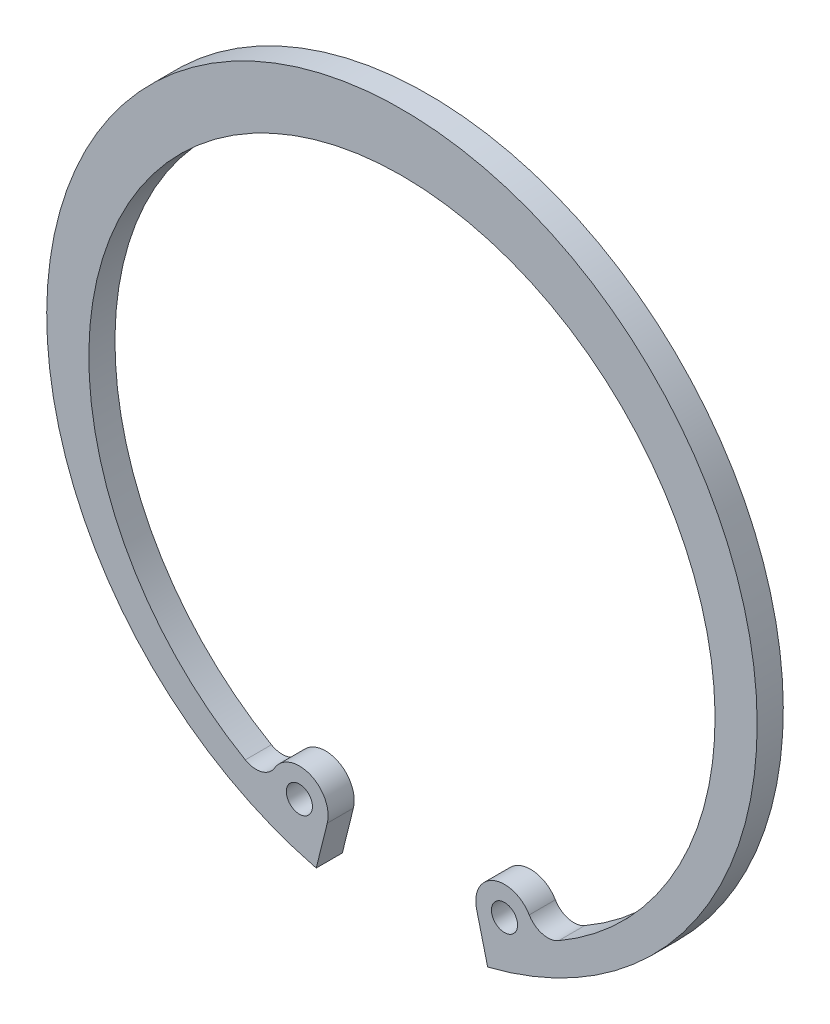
ISO-10303-21;
HEADER;
FILE_DESCRIPTION(('STEP AP214'),'2;1');
FILE_NAME('part.step','',(''),(''),'','','');
FILE_SCHEMA(('AUTOMOTIVE_DESIGN { 1 0 10303 214 1 1 1 1 }'));
ENDSEC;
DATA;
#1=APPLICATION_CONTEXT('core data for automotive mechanical design processes');
#2=APPLICATION_PROTOCOL_DEFINITION('international standard','automotive_design',2000,#1);
#3=PRODUCT_CONTEXT('',#1,'mechanical');
#4=PRODUCT('Part','Part','',(#3));
#5=PRODUCT_RELATED_PRODUCT_CATEGORY('part','',(#4));
#6=PRODUCT_DEFINITION_FORMATION('','',#4);
#7=PRODUCT_DEFINITION_CONTEXT('part definition',#1,'design');
#8=PRODUCT_DEFINITION('design','',#6,#7);
#9=PRODUCT_DEFINITION_SHAPE('','',#8);
#10=(LENGTH_UNIT() NAMED_UNIT(*) SI_UNIT(.MILLI.,.METRE.));
#11=(NAMED_UNIT(*) PLANE_ANGLE_UNIT() SI_UNIT($,.RADIAN.));
#12=(NAMED_UNIT(*) SI_UNIT($,.STERADIAN.) SOLID_ANGLE_UNIT());
#13=UNCERTAINTY_MEASURE_WITH_UNIT(LENGTH_MEASURE(1.E-05),#10,'distance_accuracy_value','');
#14=(GEOMETRIC_REPRESENTATION_CONTEXT(3) GLOBAL_UNCERTAINTY_ASSIGNED_CONTEXT((#13)) GLOBAL_UNIT_ASSIGNED_CONTEXT((#10,
#11,#12)) REPRESENTATION_CONTEXT('',''));
#15=CARTESIAN_POINT('',(0.,0.,0.));
#16=DIRECTION('',(0.,0.,1.));
#17=DIRECTION('',(1.,0.,0.));
#18=AXIS2_PLACEMENT_3D('',#15,#16,#17);
#19=CARTESIAN_POINT('',(0.,0.,-2.5));
#20=DIRECTION('',(0.,0.,1.));
#21=DIRECTION('',(1.,0.,0.));
#22=AXIS2_PLACEMENT_3D('',#19,#20,#21);
#23=CYLINDRICAL_SURFACE('',#22,34.);
#24=CARTESIAN_POINT('',(0.,0.,0.));
#25=DIRECTION('',(0.,0.,1.));
#26=DIRECTION('',(1.,0.,0.));
#27=AXIS2_PLACEMENT_3D('',#24,#25,#26);
#28=CIRCLE('',#27,34.);
#29=CARTESIAN_POINT('',(8.20417418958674,-32.9953258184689,0.));
#30=VERTEX_POINT('',#29);
#31=CARTESIAN_POINT('',(-8.20417418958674,-32.9953258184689,0.));
#32=VERTEX_POINT('',#31);
#33=EDGE_CURVE('E127',#30,#32,#28,.T.);
#34=ORIENTED_EDGE('',*,*,#33,.F.);
#35=DIRECTION('',(0.,0.,1.));
#36=VECTOR('',#35,1.);
#37=CARTESIAN_POINT('',(8.20417418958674,-32.9953258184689,-2.5));
#38=LINE('',#37,#36);
#39=CARTESIAN_POINT('',(8.20417418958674,-32.9953258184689,-2.5));
#40=VERTEX_POINT('',#39);
#41=EDGE_CURVE('E11',#40,#30,#38,.T.);
#42=ORIENTED_EDGE('',*,*,#41,.F.);
#43=CARTESIAN_POINT('',(0.,0.,-2.5));
#44=DIRECTION('',(0.,0.,1.));
#45=DIRECTION('',(1.,0.,0.));
#46=AXIS2_PLACEMENT_3D('',#43,#44,#45);
#47=CIRCLE('',#46,34.);
#48=CARTESIAN_POINT('',(-8.20417418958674,-32.9953258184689,-2.5));
#49=VERTEX_POINT('',#48);
#50=EDGE_CURVE('E148',#40,#49,#47,.T.);
#51=ORIENTED_EDGE('',*,*,#50,.T.);
#52=DIRECTION('',(0.,0.,1.));
#53=VECTOR('',#52,1.);
#54=CARTESIAN_POINT('',(-8.20417418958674,-32.9953258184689,-2.5));
#55=LINE('',#54,#53);
#56=EDGE_CURVE('E33',#49,#32,#55,.T.);
#57=ORIENTED_EDGE('',*,*,#56,.T.);
#58=EDGE_LOOP('',(#34,#42,#51,#57));
#59=FACE_BOUND('',#58,.T.);
#60=ADVANCED_FACE('F30',(#59),#23,.T.);
#61=CARTESIAN_POINT('',(8.20417418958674,-32.9953258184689,-2.5));
#62=DIRECTION('',(-0.970450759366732,-0.241299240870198,0.));
#63=DIRECTION('',(0.241299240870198,-0.970450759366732,0.));
#64=AXIS2_PLACEMENT_3D('',#61,#62,#63);
#65=PLANE('',#64);
#66=DIRECTION('',(0.241299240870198,-0.970450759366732,0.));
#67=VECTOR('',#66,1.);
#68=CARTESIAN_POINT('',(8.20417418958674,-32.9953258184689,0.));
#69=LINE('',#68,#67);
#70=CARTESIAN_POINT('',(7.14791728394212,-28.7473003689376,0.));
#71=VERTEX_POINT('',#70);
#72=EDGE_CURVE('E146',#71,#30,#69,.T.);
#73=ORIENTED_EDGE('',*,*,#72,.F.);
#74=DIRECTION('',(0.,0.,1.));
#75=VECTOR('',#74,1.);
#76=CARTESIAN_POINT('',(7.14791728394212,-28.7473003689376,-2.5));
#77=LINE('',#76,#75);
#78=CARTESIAN_POINT('',(7.14791728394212,-28.7473003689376,-2.5));
#79=VERTEX_POINT('',#78);
#80=EDGE_CURVE('E39',#79,#71,#77,.T.);
#81=ORIENTED_EDGE('',*,*,#80,.F.);
#82=DIRECTION('',(0.241299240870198,-0.970450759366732,0.));
#83=VECTOR('',#82,1.);
#84=CARTESIAN_POINT('',(8.20417418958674,-32.9953258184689,-2.5));
#85=LINE('',#84,#83);
#86=EDGE_CURVE('E117',#79,#40,#85,.T.);
#87=ORIENTED_EDGE('',*,*,#86,.T.);
#88=ORIENTED_EDGE('',*,*,#41,.T.);
#89=EDGE_LOOP('',(#73,#81,#87,#88));
#90=FACE_BOUND('',#89,.T.);
#91=ADVANCED_FACE('F160',(#90),#65,.T.);
#92=CARTESIAN_POINT('',(9.81665687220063,-28.0837274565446,-2.5));
#93=DIRECTION('',(0.,0.,1.));
#94=DIRECTION('',(1.,0.,0.));
#95=AXIS2_PLACEMENT_3D('',#92,#93,#94);
#96=CYLINDRICAL_SURFACE('',#95,2.75);
#97=CARTESIAN_POINT('',(9.81665687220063,-28.0837274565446,0.));
#98=DIRECTION('',(0.,0.,1.));
#99=DIRECTION('',(1.,0.,0.));
#100=AXIS2_PLACEMENT_3D('',#97,#98,#99);
#101=CIRCLE('',#100,2.75);
#102=CARTESIAN_POINT('',(12.1833053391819,-26.6832007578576,0.));
#103=VERTEX_POINT('',#102);
#104=EDGE_CURVE('E104',#103,#71,#101,.T.);
#105=ORIENTED_EDGE('',*,*,#104,.F.);
#106=DIRECTION('',(0.,0.,1.));
#107=VECTOR('',#106,1.);
#108=CARTESIAN_POINT('',(12.1833053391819,-26.6832007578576,-2.5));
#109=LINE('',#108,#107);
#110=CARTESIAN_POINT('',(12.1833053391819,-26.6832007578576,-2.5));
#111=VERTEX_POINT('',#110);
#112=EDGE_CURVE('E99',#111,#103,#109,.T.);
#113=ORIENTED_EDGE('',*,*,#112,.F.);
#114=CARTESIAN_POINT('',(9.81665687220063,-28.0837274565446,-2.5));
#115=DIRECTION('',(0.,0.,1.));
#116=DIRECTION('',(1.,0.,0.));
#117=AXIS2_PLACEMENT_3D('',#114,#115,#116);
#118=CIRCLE('',#117,2.75);
#119=EDGE_CURVE('E102',#111,#79,#118,.T.);
#120=ORIENTED_EDGE('',*,*,#119,.T.);
#121=ORIENTED_EDGE('',*,*,#80,.T.);
#122=EDGE_LOOP('',(#105,#113,#120,#121));
#123=FACE_BOUND('',#122,.T.);
#124=ADVANCED_FACE('F101',(#123),#96,.T.);
#125=CARTESIAN_POINT('',(13.9582916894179,-25.6328057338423,-2.5));
#126=DIRECTION('',(0.,0.,1.));
#127=DIRECTION('',(1.,0.,0.));
#128=AXIS2_PLACEMENT_3D('',#125,#126,#127);
#129=CYLINDRICAL_SURFACE('',#128,2.0625);
#130=CARTESIAN_POINT('',(13.9582916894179,-25.6328057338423,0.));
#131=DIRECTION('',(0.,0.,-1.));
#132=DIRECTION('',(1.,0.,0.));
#133=AXIS2_PLACEMENT_3D('',#130,#131,#132);
#134=CIRCLE('',#133,2.0625);
#135=CARTESIAN_POINT('',(14.9899318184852,-27.4187578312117,0.));
#136=VERTEX_POINT('',#135);
#137=EDGE_CURVE('E143',#136,#103,#134,.T.);
#138=ORIENTED_EDGE('',*,*,#137,.F.);
#139=DIRECTION('',(0.,0.,1.));
#140=VECTOR('',#139,1.);
#141=CARTESIAN_POINT('',(14.9899318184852,-27.4187578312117,-2.5));
#142=LINE('',#141,#140);
#143=CARTESIAN_POINT('',(14.9899318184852,-27.4187578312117,-2.5));
#144=VERTEX_POINT('',#143);
#145=EDGE_CURVE('E109',#144,#136,#142,.T.);
#146=ORIENTED_EDGE('',*,*,#145,.F.);
#147=CARTESIAN_POINT('',(13.9582916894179,-25.6328057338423,-2.5));
#148=DIRECTION('',(0.,0.,-1.));
#149=DIRECTION('',(1.,0.,0.));
#150=AXIS2_PLACEMENT_3D('',#147,#148,#149);
#151=CIRCLE('',#150,2.0625);
#152=EDGE_CURVE('E115',#144,#111,#151,.T.);
#153=ORIENTED_EDGE('',*,*,#152,.T.);
#154=ORIENTED_EDGE('',*,*,#112,.T.);
#155=EDGE_LOOP('',(#138,#146,#153,#154));
#156=FACE_BOUND('',#155,.T.);
#157=ADVANCED_FACE('F119',(#156),#129,.F.);
#158=CARTESIAN_POINT('',(0.,-1.46852633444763,-2.5));
#159=DIRECTION('',(0.,0.,1.));
#160=DIRECTION('',(1.,0.,0.));
#161=AXIS2_PLACEMENT_3D('',#158,#159,#160);
#162=CYLINDRICAL_SURFACE('',#161,29.9685263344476);
#163=CARTESIAN_POINT('',(0.,-1.46852633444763,0.));
#164=DIRECTION('',(0.,0.,-1.));
#165=DIRECTION('',(1.,0.,0.));
#166=AXIS2_PLACEMENT_3D('',#163,#164,#165);
#167=CIRCLE('',#166,29.9685263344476);
#168=CARTESIAN_POINT('',(-14.9899318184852,-27.4187578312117,0.));
#169=VERTEX_POINT('',#168);
#170=EDGE_CURVE('E140',#169,#136,#167,.T.);
#171=ORIENTED_EDGE('',*,*,#170,.F.);
#172=DIRECTION('',(0.,0.,1.));
#173=VECTOR('',#172,1.);
#174=CARTESIAN_POINT('',(-14.9899318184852,-27.4187578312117,-2.5));
#175=LINE('',#174,#173);
#176=CARTESIAN_POINT('',(-14.9899318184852,-27.4187578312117,-2.5));
#177=VERTEX_POINT('',#176);
#178=EDGE_CURVE('E152',#177,#169,#175,.T.);
#179=ORIENTED_EDGE('',*,*,#178,.F.);
#180=CARTESIAN_POINT('',(0.,-1.46852633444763,-2.5));
#181=DIRECTION('',(0.,0.,-1.));
#182=DIRECTION('',(1.,0.,0.));
#183=AXIS2_PLACEMENT_3D('',#180,#181,#182);
#184=CIRCLE('',#183,29.9685263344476);
#185=EDGE_CURVE('E120',#177,#144,#184,.T.);
#186=ORIENTED_EDGE('',*,*,#185,.T.);
#187=ORIENTED_EDGE('',*,*,#145,.T.);
#188=EDGE_LOOP('',(#171,#179,#186,#187));
#189=FACE_BOUND('',#188,.T.);
#190=ADVANCED_FACE('F173',(#189),#162,.F.);
#191=CARTESIAN_POINT('',(-13.9582916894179,-25.6328057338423,-2.5));
#192=DIRECTION('',(0.,0.,1.));
#193=DIRECTION('',(1.,0.,0.));
#194=AXIS2_PLACEMENT_3D('',#191,#192,#193);
#195=CYLINDRICAL_SURFACE('',#194,2.0625);
#196=CARTESIAN_POINT('',(-13.9582916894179,-25.6328057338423,0.));
#197=DIRECTION('',(0.,0.,-1.));
#198=DIRECTION('',(1.,0.,0.));
#199=AXIS2_PLACEMENT_3D('',#196,#197,#198);
#200=CIRCLE('',#199,2.0625);
#201=CARTESIAN_POINT('',(-12.1833053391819,-26.6832007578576,0.));
#202=VERTEX_POINT('',#201);
#203=EDGE_CURVE('E137',#202,#169,#200,.T.);
#204=ORIENTED_EDGE('',*,*,#203,.F.);
#205=DIRECTION('',(0.,0.,1.));
#206=VECTOR('',#205,1.);
#207=CARTESIAN_POINT('',(-12.1833053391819,-26.6832007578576,-2.5));
#208=LINE('',#207,#206);
#209=CARTESIAN_POINT('',(-12.1833053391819,-26.6832007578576,-2.5));
#210=VERTEX_POINT('',#209);
#211=EDGE_CURVE('E154',#210,#202,#208,.T.);
#212=ORIENTED_EDGE('',*,*,#211,.F.);
#213=CARTESIAN_POINT('',(-13.9582916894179,-25.6328057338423,-2.5));
#214=DIRECTION('',(0.,0.,-1.));
#215=DIRECTION('',(1.,0.,0.));
#216=AXIS2_PLACEMENT_3D('',#213,#214,#215);
#217=CIRCLE('',#216,2.0625);
#218=EDGE_CURVE('E122',#210,#177,#217,.T.);
#219=ORIENTED_EDGE('',*,*,#218,.T.);
#220=ORIENTED_EDGE('',*,*,#178,.T.);
#221=EDGE_LOOP('',(#204,#212,#219,#220));
#222=FACE_BOUND('',#221,.T.);
#223=ADVANCED_FACE('F176',(#222),#195,.F.);
#224=CARTESIAN_POINT('',(-9.81665687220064,-28.0837274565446,-2.5));
#225=DIRECTION('',(0.,0.,1.));
#226=DIRECTION('',(1.,0.,0.));
#227=AXIS2_PLACEMENT_3D('',#224,#225,#226);
#228=CYLINDRICAL_SURFACE('',#227,2.75);
#229=CARTESIAN_POINT('',(-9.81665687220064,-28.0837274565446,0.));
#230=DIRECTION('',(0.,0.,1.));
#231=DIRECTION('',(1.,0.,0.));
#232=AXIS2_PLACEMENT_3D('',#229,#230,#231);
#233=CIRCLE('',#232,2.75);
#234=CARTESIAN_POINT('',(-7.14791728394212,-28.7473003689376,0.));
#235=VERTEX_POINT('',#234);
#236=EDGE_CURVE('E134',#235,#202,#233,.T.);
#237=ORIENTED_EDGE('',*,*,#236,.F.);
#238=DIRECTION('',(0.,0.,1.));
#239=VECTOR('',#238,1.);
#240=CARTESIAN_POINT('',(-7.14791728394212,-28.7473003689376,-2.5));
#241=LINE('',#240,#239);
#242=CARTESIAN_POINT('',(-7.14791728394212,-28.7473003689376,-2.5));
#243=VERTEX_POINT('',#242);
#244=EDGE_CURVE('E155',#243,#235,#241,.T.);
#245=ORIENTED_EDGE('',*,*,#244,.F.);
#246=CARTESIAN_POINT('',(-9.81665687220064,-28.0837274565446,-2.5));
#247=DIRECTION('',(0.,0.,1.));
#248=DIRECTION('',(1.,0.,0.));
#249=AXIS2_PLACEMENT_3D('',#246,#247,#248);
#250=CIRCLE('',#249,2.75);
#251=EDGE_CURVE('E222',#243,#210,#250,.T.);
#252=ORIENTED_EDGE('',*,*,#251,.T.);
#253=ORIENTED_EDGE('',*,*,#211,.T.);
#254=EDGE_LOOP('',(#237,#245,#252,#253));
#255=FACE_BOUND('',#254,.T.);
#256=ADVANCED_FACE('F180',(#255),#228,.T.);
#257=CARTESIAN_POINT('',(-8.20417418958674,-32.9953258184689,-2.5));
#258=DIRECTION('',(0.970450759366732,-0.241299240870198,0.));
#259=DIRECTION('',(0.241299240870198,0.970450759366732,0.));
#260=AXIS2_PLACEMENT_3D('',#257,#258,#259);
#261=PLANE('',#260);
#262=DIRECTION('',(0.241299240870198,0.970450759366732,0.));
#263=VECTOR('',#262,1.);
#264=CARTESIAN_POINT('',(-8.20417418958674,-32.9953258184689,0.));
#265=LINE('',#264,#263);
#266=EDGE_CURVE('E130',#32,#235,#265,.T.);
#267=ORIENTED_EDGE('',*,*,#266,.F.);
#268=ORIENTED_EDGE('',*,*,#56,.F.);
#269=DIRECTION('',(0.241299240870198,0.970450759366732,0.));
#270=VECTOR('',#269,1.);
#271=CARTESIAN_POINT('',(-8.20417418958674,-32.9953258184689,-2.5));
#272=LINE('',#271,#270);
#273=EDGE_CURVE('E220',#49,#243,#272,.T.);
#274=ORIENTED_EDGE('',*,*,#273,.T.);
#275=ORIENTED_EDGE('',*,*,#244,.T.);
#276=EDGE_LOOP('',(#267,#268,#274,#275));
#277=FACE_BOUND('',#276,.T.);
#278=ADVANCED_FACE('F157',(#277),#261,.T.);
#279=CARTESIAN_POINT('',(0.,0.,-2.5));
#280=DIRECTION('',(0.,0.,1.));
#281=DIRECTION('',(1.,0.,0.));
#282=AXIS2_PLACEMENT_3D('',#279,#280,#281);
#283=PLANE('',#282);
#284=CARTESIAN_POINT('',(-9.81665687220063,-28.0837274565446,-2.5));
#285=DIRECTION('',(0.,0.,1.));
#286=DIRECTION('',(1.,0.,0.));
#287=AXIS2_PLACEMENT_3D('',#284,#285,#286);
#288=CIRCLE('',#287,1.25);
#289=CARTESIAN_POINT('',(-8.56665687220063,-28.0837274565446,-2.5));
#290=VERTEX_POINT('',#289);
#291=EDGE_CURVE('E207',#290,#290,#288,.T.);
#292=ORIENTED_EDGE('',*,*,#291,.T.);
#293=EDGE_LOOP('',(#292));
#294=FACE_BOUND('',#293,.T.);
#295=CARTESIAN_POINT('',(9.81665687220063,-28.0837274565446,-2.5));
#296=DIRECTION('',(0.,0.,1.));
#297=DIRECTION('',(1.,0.,0.));
#298=AXIS2_PLACEMENT_3D('',#295,#296,#297);
#299=CIRCLE('',#298,1.25);
#300=CARTESIAN_POINT('',(11.0666568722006,-28.0837274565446,-2.5));
#301=VERTEX_POINT('',#300);
#302=EDGE_CURVE('E131',#301,#301,#299,.T.);
#303=ORIENTED_EDGE('',*,*,#302,.T.);
#304=EDGE_LOOP('',(#303));
#305=FACE_BOUND('',#304,.T.);
#306=ORIENTED_EDGE('',*,*,#50,.F.);
#307=ORIENTED_EDGE('',*,*,#86,.F.);
#308=ORIENTED_EDGE('',*,*,#119,.F.);
#309=ORIENTED_EDGE('',*,*,#152,.F.);
#310=ORIENTED_EDGE('',*,*,#185,.F.);
#311=ORIENTED_EDGE('',*,*,#218,.F.);
#312=ORIENTED_EDGE('',*,*,#251,.F.);
#313=ORIENTED_EDGE('',*,*,#273,.F.);
#314=EDGE_LOOP('',(#306,#307,#308,#309,#310,#311,#312,#313));
#315=FACE_BOUND('',#314,.T.);
#316=ADVANCED_FACE('F113',(#294,#305,#315),#283,.F.);
#317=CARTESIAN_POINT('',(0.,0.,0.));
#318=DIRECTION('',(0.,0.,1.));
#319=DIRECTION('',(1.,0.,0.));
#320=AXIS2_PLACEMENT_3D('',#317,#318,#319);
#321=PLANE('',#320);
#322=CARTESIAN_POINT('',(-9.81665687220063,-28.0837274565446,0.));
#323=DIRECTION('',(0.,0.,1.));
#324=DIRECTION('',(1.,0.,0.));
#325=AXIS2_PLACEMENT_3D('',#322,#323,#324);
#326=CIRCLE('',#325,1.25);
#327=CARTESIAN_POINT('',(-8.56665687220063,-28.0837274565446,0.));
#328=VERTEX_POINT('',#327);
#329=EDGE_CURVE('E210',#328,#328,#326,.T.);
#330=ORIENTED_EDGE('',*,*,#329,.F.);
#331=EDGE_LOOP('',(#330));
#332=FACE_BOUND('',#331,.T.);
#333=CARTESIAN_POINT('',(9.81665687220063,-28.0837274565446,0.));
#334=DIRECTION('',(0.,0.,1.));
#335=DIRECTION('',(1.,0.,0.));
#336=AXIS2_PLACEMENT_3D('',#333,#334,#335);
#337=CIRCLE('',#336,1.25);
#338=CARTESIAN_POINT('',(11.0666568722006,-28.0837274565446,0.));
#339=VERTEX_POINT('',#338);
#340=EDGE_CURVE('E212',#339,#339,#337,.T.);
#341=ORIENTED_EDGE('',*,*,#340,.F.);
#342=EDGE_LOOP('',(#341));
#343=FACE_BOUND('',#342,.T.);
#344=ORIENTED_EDGE('',*,*,#33,.T.);
#345=ORIENTED_EDGE('',*,*,#266,.T.);
#346=ORIENTED_EDGE('',*,*,#236,.T.);
#347=ORIENTED_EDGE('',*,*,#203,.T.);
#348=ORIENTED_EDGE('',*,*,#170,.T.);
#349=ORIENTED_EDGE('',*,*,#137,.T.);
#350=ORIENTED_EDGE('',*,*,#104,.T.);
#351=ORIENTED_EDGE('',*,*,#72,.T.);
#352=EDGE_LOOP('',(#344,#345,#346,#347,#348,#349,#350,#351));
#353=FACE_BOUND('',#352,.T.);
#354=ADVANCED_FACE('F159',(#332,#343,#353),#321,.T.);
#355=CARTESIAN_POINT('',(9.81665687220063,-28.0837274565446,-2.5));
#356=DIRECTION('',(0.,0.,1.));
#357=DIRECTION('',(1.,0.,0.));
#358=AXIS2_PLACEMENT_3D('',#355,#356,#357);
#359=CYLINDRICAL_SURFACE('',#358,1.25);
#360=ORIENTED_EDGE('',*,*,#302,.F.);
#361=EDGE_LOOP('',(#360));
#362=FACE_BOUND('',#361,.T.);
#363=ORIENTED_EDGE('',*,*,#340,.T.);
#364=EDGE_LOOP('',(#363));
#365=FACE_BOUND('',#364,.T.);
#366=ADVANCED_FACE('F192',(#362,#365),#359,.F.);
#367=CARTESIAN_POINT('',(-9.81665687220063,-28.0837274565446,-2.5));
#368=DIRECTION('',(0.,0.,1.));
#369=DIRECTION('',(1.,0.,0.));
#370=AXIS2_PLACEMENT_3D('',#367,#368,#369);
#371=CYLINDRICAL_SURFACE('',#370,1.25);
#372=ORIENTED_EDGE('',*,*,#291,.F.);
#373=EDGE_LOOP('',(#372));
#374=FACE_BOUND('',#373,.T.);
#375=ORIENTED_EDGE('',*,*,#329,.T.);
#376=EDGE_LOOP('',(#375));
#377=FACE_BOUND('',#376,.T.);
#378=ADVANCED_FACE('F199',(#374,#377),#371,.F.);
#379=CLOSED_SHELL('',(#60,#91,#124,#157,#190,#223,#256,#278,#316,#354,#366,#378));
#380=MANIFOLD_SOLID_BREP('B2',#379);
#381=ADVANCED_BREP_SHAPE_REPRESENTATION('',(#18,#380),#14);
#382=SHAPE_DEFINITION_REPRESENTATION(#9,#381);
ENDSEC;
END-ISO-10303-21;
